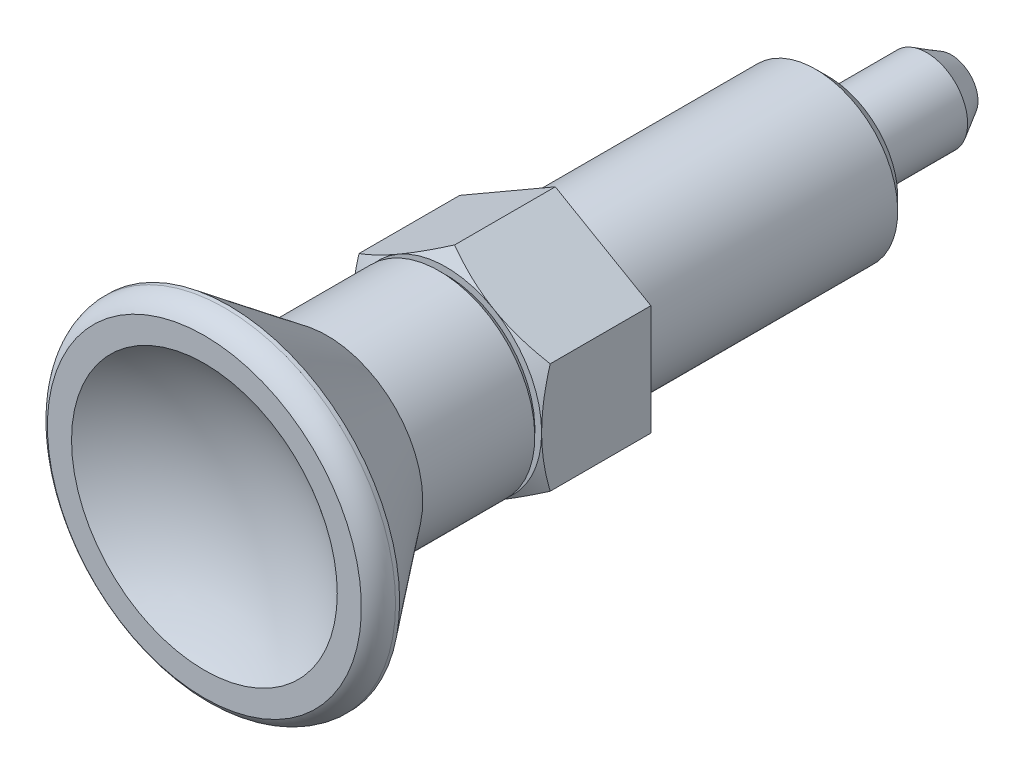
ISO-10303-21;
HEADER;
FILE_DESCRIPTION(('STEP AP214'),'2;1');
FILE_NAME('part.step','',(''),(''),'','','');
FILE_SCHEMA(('AUTOMOTIVE_DESIGN { 1 0 10303 214 1 1 1 1 }'));
ENDSEC;
DATA;
#1=APPLICATION_CONTEXT('core data for automotive mechanical design processes');
#2=APPLICATION_PROTOCOL_DEFINITION('international standard','automotive_design',2000,#1);
#3=PRODUCT_CONTEXT('',#1,'mechanical');
#4=PRODUCT('Part','Part','',(#3));
#5=PRODUCT_RELATED_PRODUCT_CATEGORY('part','',(#4));
#6=PRODUCT_DEFINITION_FORMATION('','',#4);
#7=PRODUCT_DEFINITION_CONTEXT('part definition',#1,'design');
#8=PRODUCT_DEFINITION('design','',#6,#7);
#9=PRODUCT_DEFINITION_SHAPE('','',#8);
#10=(LENGTH_UNIT() NAMED_UNIT(*) SI_UNIT(.MILLI.,.METRE.));
#11=(NAMED_UNIT(*) PLANE_ANGLE_UNIT() SI_UNIT($,.RADIAN.));
#12=(NAMED_UNIT(*) SI_UNIT($,.STERADIAN.) SOLID_ANGLE_UNIT());
#13=UNCERTAINTY_MEASURE_WITH_UNIT(LENGTH_MEASURE(1.E-05),#10,'distance_accuracy_value','');
#14=(GEOMETRIC_REPRESENTATION_CONTEXT(3) GLOBAL_UNCERTAINTY_ASSIGNED_CONTEXT((#13)) GLOBAL_UNIT_ASSIGNED_CONTEXT((#10,
#11,#12)) REPRESENTATION_CONTEXT('',''));
#15=CARTESIAN_POINT('',(0.,0.,0.));
#16=DIRECTION('',(0.,0.,1.));
#17=DIRECTION('',(1.,0.,0.));
#18=AXIS2_PLACEMENT_3D('',#15,#16,#17);
#19=CARTESIAN_POINT('',(0.,0.,6.2679491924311));
#20=DIRECTION('',(0.,0.,-1.));
#21=DIRECTION('',(0.,1.,0.));
#22=AXIS2_PLACEMENT_3D('',#19,#20,#21);
#23=CONICAL_SURFACE('',#22,10.,1.0471975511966);
#24=CARTESIAN_POINT('',(-7.,10.8728092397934,4.57557437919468));
#25=CARTESIAN_POINT('',(-7.,10.566937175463,4.72401792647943));
#26=CARTESIAN_POINT('',(-7.,10.260364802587,4.87104307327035));
#27=CARTESIAN_POINT('',(-7.,9.64544708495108,5.16145919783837));
#28=CARTESIAN_POINT('',(-7.,9.33710147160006,5.30484960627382));
#29=CARTESIAN_POINT('',(-7.,8.71668430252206,5.58791667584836));
#30=CARTESIAN_POINT('',(-7.,8.404601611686,5.72756901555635));
#31=CARTESIAN_POINT('',(-7.,7.77796010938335,6.00118155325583));
#32=CARTESIAN_POINT('',(-7.,7.46340141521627,6.13514201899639));
#33=CARTESIAN_POINT('',(-7.,6.82107443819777,6.40008958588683));
#34=CARTESIAN_POINT('',(-7.,6.49320807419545,6.53084021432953));
#35=CARTESIAN_POINT('',(-7.,5.83364655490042,6.78248688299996));
#36=CARTESIAN_POINT('',(-7.,5.50195097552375,6.90338181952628));
#37=CARTESIAN_POINT('',(-7.,4.83481472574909,7.13215538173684));
#38=CARTESIAN_POINT('',(-7.,4.49938313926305,7.24006021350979));
#39=CARTESIAN_POINT('',(-7.,3.82372022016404,7.43940359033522));
#40=CARTESIAN_POINT('',(-7.,3.48349043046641,7.53084730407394));
#41=CARTESIAN_POINT('',(-7.,2.79988120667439,7.6923959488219));
#42=CARTESIAN_POINT('',(-7.,2.45653013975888,7.76261768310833));
#43=CARTESIAN_POINT('',(-7.,1.93836281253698,7.8490042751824));
#44=CARTESIAN_POINT('',(-7.,1.76510408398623,7.8746433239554));
#45=CARTESIAN_POINT('',(-7.,1.41772046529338,7.91910342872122));
#46=CARTESIAN_POINT('',(-7.,1.2435956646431,7.93792517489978));
#47=CARTESIAN_POINT('',(-7.,0.896993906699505,7.96813897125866));
#48=CARTESIAN_POINT('',(-7.,0.72452516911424,7.97962494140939));
#49=CARTESIAN_POINT('',(-7.,0.379256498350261,7.99529235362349));
#50=CARTESIAN_POINT('',(-7.,0.20645657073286,7.99947391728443));
#51=CARTESIAN_POINT('',(-7.,-0.139165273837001,8.00043271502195));
#52=CARTESIAN_POINT('',(-7.,-0.31198719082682,7.99720993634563));
#53=CARTESIAN_POINT('',(-7.,-0.65734110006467,7.9834390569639));
#54=CARTESIAN_POINT('',(-7.,-0.829873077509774,7.97289059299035));
#55=CARTESIAN_POINT('',(-7.,-1.24401482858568,7.93900155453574));
#56=CARTESIAN_POINT('',(-7.,-1.4853484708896,7.9122132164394));
#57=CARTESIAN_POINT('',(-7.,-1.96622430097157,7.84576103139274));
#58=CARTESIAN_POINT('',(-7.,-2.20576624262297,7.80609544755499));
#59=CARTESIAN_POINT('',(-7.,-2.9214316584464,7.66988610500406));
#60=CARTESIAN_POINT('',(-7.,-3.39432712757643,7.55615455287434));
#61=CARTESIAN_POINT('',(-7.,-4.10143138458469,7.35893674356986));
#62=CARTESIAN_POINT('',(-7.,-4.33930824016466,7.28784545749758));
#63=CARTESIAN_POINT('',(-7.,-4.81275170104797,7.13827828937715));
#64=CARTESIAN_POINT('',(-7.,-5.04831829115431,7.0598023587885));
#65=CARTESIAN_POINT('',(-7.,-5.51721503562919,6.89672505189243));
#66=CARTESIAN_POINT('',(-7.,-5.75054589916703,6.81212569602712));
#67=CARTESIAN_POINT('',(-7.,-6.21527462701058,6.63779697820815));
#68=CARTESIAN_POINT('',(-7.,-6.44667251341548,6.54806767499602));
#69=CARTESIAN_POINT('',(-7.,-6.9904007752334,6.33139429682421));
#70=CARTESIAN_POINT('',(-7.,-7.30200844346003,6.20264005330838));
#71=CARTESIAN_POINT('',(-7.,-7.92258489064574,5.93890362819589));
#72=CARTESIAN_POINT('',(-7.,-8.23155350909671,5.80392107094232));
#73=CARTESIAN_POINT('',(-7.,-8.84733332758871,5.52897125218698));
#74=CARTESIAN_POINT('',(-7.,-9.15414408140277,5.38900299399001));
#75=CARTESIAN_POINT('',(-7.,-9.76591583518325,5.10507365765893));
#76=CARTESIAN_POINT('',(-7.,-10.0708767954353,4.96111249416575));
#77=CARTESIAN_POINT('',(-7.,-10.6795676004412,4.66979092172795));
#78=CARTESIAN_POINT('',(-7.,-10.983295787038,4.52242705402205));
#79=CARTESIAN_POINT('',(-7.,-11.589440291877,4.22502308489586));
#80=CARTESIAN_POINT('',(-7.,-11.8918565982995,4.07498295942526));
#81=CARTESIAN_POINT('',(-7.,-12.7973693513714,3.62159659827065));
#82=CARTESIAN_POINT('',(-7.,-13.3988107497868,3.31494523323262));
#83=CARTESIAN_POINT('',(-7.,-14.5484593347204,2.7212659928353));
#84=CARTESIAN_POINT('',(-7.,-15.0969237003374,2.43473390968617));
#85=CARTESIAN_POINT('',(-7.,-16.1918004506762,1.85773227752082));
#86=CARTESIAN_POINT('',(-7.,-16.7382127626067,1.56726259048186));
#87=CARTESIAN_POINT('',(-7.,-17.8280753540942,0.984049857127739));
#88=CARTESIAN_POINT('',(-7.,-18.3715296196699,0.691314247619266));
#89=CARTESIAN_POINT('',(-7.,-19.4571245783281,0.103487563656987));
#90=CARTESIAN_POINT('',(-7.,-19.9992653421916,-0.191603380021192));
#91=CARTESIAN_POINT('',(-7.,-20.5409220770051,-0.48757414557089));
#92=B_SPLINE_CURVE_WITH_KNOTS('',3,(#24,#25,#26,#27,#28,#29,#30,#31,#32,#33,#34,#35,#36,#37,#38,
#39,#40,#41,#42,#43,#44,#45,#46,#47,#48,#49,#50,#51,#52,#53,#54,#55,#56,#57,#58,#59,#60,#61,#62,
#63,#64,#65,#66,#67,#68,#69,#70,#71,#72,#73,#74,#75,#76,#77,#78,#79,#80,#81,#82,#83,#84,#85,#86,
#87,#88,#89,#90,#91),.UNSPECIFIED.,.F.,.F.,(4,2,2,2,2,2,2,2,2,2,2,2,2,2,2,2,2,2,2,2,2,2,2,2,2,2,
2,2,2,2,2,2,2,4),(0.,1.01998239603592,2.0401235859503,3.06579018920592,4.0914084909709,
5.15021362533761,6.20913716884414,7.26588732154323,8.32230508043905,9.37279786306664,
9.89812137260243,10.4233916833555,10.9417945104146,11.4601887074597,11.9785837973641,
12.4970045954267,13.2250410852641,13.953175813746,15.4102478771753,16.1550039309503,
16.8997648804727,17.6442812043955,18.3887890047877,19.4001785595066,20.4116291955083,
21.4232831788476,22.434958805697,23.4477124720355,24.4604752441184,26.485730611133,
28.3421144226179,30.1985634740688,32.0504023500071,33.9021391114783),.UNSPECIFIED.);
#93=CARTESIAN_POINT('',(-7.,-4.0414518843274,7.3747852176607));
#94=VERTEX_POINT('',#93);
#95=CARTESIAN_POINT('',(-7.,0.,8.));
#96=VERTEX_POINT('',#95);
#97=EDGE_CURVE('E9',#94,#96,#92,.F.);
#98=ORIENTED_EDGE('',*,*,#97,.F.);
#99=CARTESIAN_POINT('',(0.00020000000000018,-8.08301923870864,7.37471854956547));
#100=CARTESIAN_POINT('',(-0.153667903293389,-7.99418356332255,7.42600015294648));
#101=CARTESIAN_POINT('',(-0.308109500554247,-7.90501666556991,7.47495440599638));
#102=CARTESIAN_POINT('',(-0.618246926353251,-7.72595873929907,7.56756721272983));
#103=CARTESIAN_POINT('',(-0.773943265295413,-7.63606741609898,7.6112234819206));
#104=CARTESIAN_POINT('',(-1.24352516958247,-7.36495417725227,7.73338840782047));
#105=CARTESIAN_POINT('',(-1.55926433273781,-7.18266208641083,7.80287444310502));
#106=CARTESIAN_POINT('',(-2.03176224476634,-6.90986528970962,7.88435504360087));
#107=CARTESIAN_POINT('',(-2.1871092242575,-6.8201756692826,7.9075665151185));
#108=CARTESIAN_POINT('',(-2.49850511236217,-6.64039116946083,7.94648878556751));
#109=CARTESIAN_POINT('',(-2.65455395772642,-6.55029632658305,7.96220024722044));
#110=CARTESIAN_POINT('',(-2.96692267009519,-6.36995016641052,7.98572208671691));
#111=CARTESIAN_POINT('',(-3.12324202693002,-6.27969914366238,7.9935414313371));
#112=CARTESIAN_POINT('',(-3.43601650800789,-6.09911871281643,8.00111975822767));
#113=CARTESIAN_POINT('',(-3.59247162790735,-6.00878930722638,8.000878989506));
#114=CARTESIAN_POINT('',(-4.02110687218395,-5.76131663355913,7.9891402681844));
#115=CARTESIAN_POINT('',(-4.29314668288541,-5.60425437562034,7.96943425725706));
#116=CARTESIAN_POINT('',(-4.8354194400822,-5.29117305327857,7.90694653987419));
#117=CARTESIAN_POINT('',(-5.10565047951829,-5.13515508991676,7.86414347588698));
#118=CARTESIAN_POINT('',(-5.64901454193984,-4.8214437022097,7.75714832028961));
#119=CARTESIAN_POINT('',(-5.92207900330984,-4.66378986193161,7.6925029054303));
#120=CARTESIAN_POINT('',(-6.46413578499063,-4.35083323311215,7.54578392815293));
#121=CARTESIAN_POINT('',(-6.73313504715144,-4.19552643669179,7.46374482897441));
#122=CARTESIAN_POINT('',(-7.0002,-4.04133641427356,7.37471854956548));
#123=B_SPLINE_CURVE_WITH_KNOTS('',3,(#99,#100,#101,#102,#103,#104,#105,#106,#107,#108,#109,#110,
#111,#112,#113,#114,#115,#116,#117,#118,#119,#120,#121,#122),.UNSPECIFIED.,.F.,.F.,(4,2,2,2,2,2,
2,2,2,2,2,4),(0.,0.554727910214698,1.1096941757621,2.22193274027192,2.76443041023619,
3.3068801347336,3.84871284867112,4.39052882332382,5.33376515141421,6.27787517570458,
7.24292418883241,8.20607866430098),.UNSPECIFIED.);
#124=CARTESIAN_POINT('',(-3.5,-6.06217782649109,8.));
#125=VERTEX_POINT('',#124);
#126=EDGE_CURVE('E201',#125,#94,#123,.T.);
#127=ORIENTED_EDGE('',*,*,#126,.F.);
#128=CARTESIAN_POINT('',(0.,0.,8.));
#129=DIRECTION('',(0.,0.,1.));
#130=DIRECTION('',(0.,-1.,0.));
#131=AXIS2_PLACEMENT_3D('',#128,#129,#130);
#132=CIRCLE('',#131,7.);
#133=EDGE_CURVE('E260',#96,#125,#132,.T.);
#134=ORIENTED_EDGE('',*,*,#133,.F.);
#135=EDGE_LOOP('',(#98,#127,#134));
#136=FACE_BOUND('',#135,.T.);
#137=ADVANCED_FACE('F14',(#136),#23,.T.);
#138=CARTESIAN_POINT('',(-7.,4.0414518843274,7.3747852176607));
#139=VERTEX_POINT('',#138);
#140=EDGE_CURVE('E18',#96,#139,#92,.F.);
#141=ORIENTED_EDGE('',*,*,#140,.F.);
#142=CARTESIAN_POINT('',(-3.5,6.06217782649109,8.));
#143=VERTEX_POINT('',#142);
#144=EDGE_CURVE('E116',#143,#96,#132,.T.);
#145=ORIENTED_EDGE('',*,*,#144,.F.);
#146=CARTESIAN_POINT('',(-7.0002,4.04133641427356,7.37471854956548));
#147=CARTESIAN_POINT('',(-6.84633209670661,4.13017208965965,7.42600015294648));
#148=CARTESIAN_POINT('',(-6.69189049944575,4.21933898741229,7.47495440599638));
#149=CARTESIAN_POINT('',(-6.38175307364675,4.39839691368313,7.56756721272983));
#150=CARTESIAN_POINT('',(-6.22605673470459,4.48828823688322,7.6112234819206));
#151=CARTESIAN_POINT('',(-5.75647483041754,4.75940147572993,7.73338840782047));
#152=CARTESIAN_POINT('',(-5.4407356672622,4.94169356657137,7.80287444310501));
#153=CARTESIAN_POINT('',(-4.96823775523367,5.21449036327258,7.88435504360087));
#154=CARTESIAN_POINT('',(-4.81289077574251,5.30417998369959,7.90756651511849));
#155=CARTESIAN_POINT('',(-4.50149488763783,5.48396448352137,7.9464887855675));
#156=CARTESIAN_POINT('',(-4.34544604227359,5.57405932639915,7.96220024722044));
#157=CARTESIAN_POINT('',(-4.03307732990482,5.75440548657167,7.9857220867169));
#158=CARTESIAN_POINT('',(-3.87675797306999,5.84465650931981,7.9935414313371));
#159=CARTESIAN_POINT('',(-3.56398349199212,6.02523694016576,8.00111975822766));
#160=CARTESIAN_POINT('',(-3.40752837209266,6.11556634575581,8.00087898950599));
#161=CARTESIAN_POINT('',(-2.97889312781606,6.36303901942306,7.98914026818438));
#162=CARTESIAN_POINT('',(-2.7068533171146,6.52010127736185,7.96943425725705));
#163=CARTESIAN_POINT('',(-2.1645805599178,6.83318259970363,7.90694653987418));
#164=CARTESIAN_POINT('',(-1.89434952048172,6.98920056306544,7.86414347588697));
#165=CARTESIAN_POINT('',(-1.35098545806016,7.30291195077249,7.7571483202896));
#166=CARTESIAN_POINT('',(-1.07792099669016,7.46056579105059,7.69250290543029));
#167=CARTESIAN_POINT('',(-0.535864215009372,7.77352241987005,7.54578392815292));
#168=CARTESIAN_POINT('',(-0.266864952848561,7.92882921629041,7.4637448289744));
#169=CARTESIAN_POINT('',(0.000200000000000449,8.08301923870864,7.37471854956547));
#170=B_SPLINE_CURVE_WITH_KNOTS('',3,(#146,#147,#148,#149,#150,#151,#152,#153,#154,#155,#156,
#157,#158,#159,#160,#161,#162,#163,#164,#165,#166,#167,#168,#169),.UNSPECIFIED.,.F.,.F.,(4,2,2,
2,2,2,2,2,2,2,2,4),(0.,0.554727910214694,1.10969417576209,2.22193274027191,2.76443041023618,
3.30688013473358,3.84871284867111,4.3905288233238,5.33376515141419,6.27787517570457,
7.24292418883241,8.20607866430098),.UNSPECIFIED.);
#171=EDGE_CURVE('E263',#139,#143,#170,.T.);
#172=ORIENTED_EDGE('',*,*,#171,.F.);
#173=EDGE_LOOP('',(#141,#145,#172));
#174=FACE_BOUND('',#173,.T.);
#175=ADVANCED_FACE('F222',(#174),#23,.T.);
#176=CARTESIAN_POINT('',(0.,8.0829037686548,7.37478521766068));
#177=VERTEX_POINT('',#176);
#178=EDGE_CURVE('E112',#143,#177,#170,.T.);
#179=ORIENTED_EDGE('',*,*,#178,.F.);
#180=CARTESIAN_POINT('',(3.5,6.06217782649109,8.));
#181=VERTEX_POINT('',#180);
#182=EDGE_CURVE('E110',#181,#143,#132,.T.);
#183=ORIENTED_EDGE('',*,*,#182,.F.);
#184=CARTESIAN_POINT('',(-0.00020000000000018,8.08301923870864,7.37471854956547));
#185=CARTESIAN_POINT('',(0.153667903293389,7.99418356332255,7.42600015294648));
#186=CARTESIAN_POINT('',(0.308109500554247,7.90501666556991,7.47495440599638));
#187=CARTESIAN_POINT('',(0.618246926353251,7.72595873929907,7.56756721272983));
#188=CARTESIAN_POINT('',(0.773943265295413,7.63606741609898,7.6112234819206));
#189=CARTESIAN_POINT('',(1.24352516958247,7.36495417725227,7.73338840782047));
#190=CARTESIAN_POINT('',(1.55926433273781,7.18266208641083,7.80287444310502));
#191=CARTESIAN_POINT('',(2.03176224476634,6.90986528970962,7.88435504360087));
#192=CARTESIAN_POINT('',(2.1871092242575,6.8201756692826,7.9075665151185));
#193=CARTESIAN_POINT('',(2.49850511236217,6.64039116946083,7.94648878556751));
#194=CARTESIAN_POINT('',(2.65455395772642,6.55029632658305,7.96220024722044));
#195=CARTESIAN_POINT('',(2.96692267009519,6.36995016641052,7.98572208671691));
#196=CARTESIAN_POINT('',(3.12324202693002,6.27969914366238,7.9935414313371));
#197=CARTESIAN_POINT('',(3.43601650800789,6.09911871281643,8.00111975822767));
#198=CARTESIAN_POINT('',(3.59247162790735,6.00878930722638,8.000878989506));
#199=CARTESIAN_POINT('',(4.02110687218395,5.76131663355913,7.9891402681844));
#200=CARTESIAN_POINT('',(4.29314668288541,5.60425437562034,7.96943425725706));
#201=CARTESIAN_POINT('',(4.8354194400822,5.29117305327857,7.90694653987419));
#202=CARTESIAN_POINT('',(5.10565047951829,5.13515508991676,7.86414347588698));
#203=CARTESIAN_POINT('',(5.64901454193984,4.8214437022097,7.75714832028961));
#204=CARTESIAN_POINT('',(5.92207900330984,4.66378986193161,7.6925029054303));
#205=CARTESIAN_POINT('',(6.46413578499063,4.35083323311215,7.54578392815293));
#206=CARTESIAN_POINT('',(6.73313504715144,4.19552643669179,7.46374482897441));
#207=CARTESIAN_POINT('',(7.0002,4.04133641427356,7.37471854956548));
#208=B_SPLINE_CURVE_WITH_KNOTS('',3,(#184,#185,#186,#187,#188,#189,#190,#191,#192,#193,#194,
#195,#196,#197,#198,#199,#200,#201,#202,#203,#204,#205,#206,#207),.UNSPECIFIED.,.F.,.F.,(4,2,2,
2,2,2,2,2,2,2,2,4),(0.,0.554727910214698,1.1096941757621,2.22193274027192,2.76443041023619,
3.3068801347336,3.84871284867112,4.39052882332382,5.33376515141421,6.27787517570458,
7.24292418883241,8.20607866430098),.UNSPECIFIED.);
#209=EDGE_CURVE('E90',#177,#181,#208,.T.);
#210=ORIENTED_EDGE('',*,*,#209,.F.);
#211=EDGE_LOOP('',(#179,#183,#210));
#212=FACE_BOUND('',#211,.T.);
#213=ADVANCED_FACE('F111',(#212),#23,.T.);
#214=CARTESIAN_POINT('',(0.,-8.0829037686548,7.37478521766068));
#215=VERTEX_POINT('',#214);
#216=EDGE_CURVE('E196',#215,#125,#123,.T.);
#217=ORIENTED_EDGE('',*,*,#216,.F.);
#218=CARTESIAN_POINT('',(7.0002,-4.04133641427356,7.37471854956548));
#219=CARTESIAN_POINT('',(6.84633209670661,-4.13017208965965,7.42600015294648));
#220=CARTESIAN_POINT('',(6.69189049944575,-4.21933898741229,7.47495440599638));
#221=CARTESIAN_POINT('',(6.38175307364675,-4.39839691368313,7.56756721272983));
#222=CARTESIAN_POINT('',(6.22605673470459,-4.48828823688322,7.6112234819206));
#223=CARTESIAN_POINT('',(5.75647483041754,-4.75940147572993,7.73338840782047));
#224=CARTESIAN_POINT('',(5.4407356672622,-4.94169356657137,7.80287444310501));
#225=CARTESIAN_POINT('',(4.96823775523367,-5.21449036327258,7.88435504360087));
#226=CARTESIAN_POINT('',(4.81289077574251,-5.30417998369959,7.90756651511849));
#227=CARTESIAN_POINT('',(4.50149488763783,-5.48396448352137,7.9464887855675));
#228=CARTESIAN_POINT('',(4.34544604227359,-5.57405932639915,7.96220024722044));
#229=CARTESIAN_POINT('',(4.03307732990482,-5.75440548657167,7.9857220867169));
#230=CARTESIAN_POINT('',(3.87675797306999,-5.84465650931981,7.9935414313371));
#231=CARTESIAN_POINT('',(3.56398349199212,-6.02523694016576,8.00111975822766));
#232=CARTESIAN_POINT('',(3.40752837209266,-6.11556634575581,8.00087898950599));
#233=CARTESIAN_POINT('',(2.97889312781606,-6.36303901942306,7.98914026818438));
#234=CARTESIAN_POINT('',(2.7068533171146,-6.52010127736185,7.96943425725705));
#235=CARTESIAN_POINT('',(2.1645805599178,-6.83318259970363,7.90694653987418));
#236=CARTESIAN_POINT('',(1.89434952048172,-6.98920056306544,7.86414347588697));
#237=CARTESIAN_POINT('',(1.35098545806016,-7.30291195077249,7.7571483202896));
#238=CARTESIAN_POINT('',(1.07792099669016,-7.46056579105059,7.69250290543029));
#239=CARTESIAN_POINT('',(0.535864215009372,-7.77352241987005,7.54578392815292));
#240=CARTESIAN_POINT('',(0.266864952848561,-7.92882921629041,7.4637448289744));
#241=CARTESIAN_POINT('',(-0.000200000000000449,-8.08301923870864,7.37471854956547));
#242=B_SPLINE_CURVE_WITH_KNOTS('',3,(#218,#219,#220,#221,#222,#223,#224,#225,#226,#227,#228,
#229,#230,#231,#232,#233,#234,#235,#236,#237,#238,#239,#240,#241),.UNSPECIFIED.,.F.,.F.,(4,2,2,
2,2,2,2,2,2,2,2,4),(0.,0.554727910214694,1.10969417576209,2.22193274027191,2.76443041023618,
3.30688013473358,3.84871284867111,4.3905288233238,5.33376515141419,6.27787517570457,
7.24292418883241,8.20607866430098),.UNSPECIFIED.);
#243=CARTESIAN_POINT('',(3.5,-6.06217782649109,8.));
#244=VERTEX_POINT('',#243);
#245=EDGE_CURVE('E100',#244,#215,#242,.T.);
#246=ORIENTED_EDGE('',*,*,#245,.F.);
#247=EDGE_CURVE('E123',#125,#244,#132,.T.);
#248=ORIENTED_EDGE('',*,*,#247,.F.);
#249=EDGE_LOOP('',(#217,#246,#248));
#250=FACE_BOUND('',#249,.T.);
#251=ADVANCED_FACE('F242',(#250),#23,.T.);
#252=CARTESIAN_POINT('',(7.,4.0414518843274,7.3747852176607));
#253=VERTEX_POINT('',#252);
#254=EDGE_CURVE('E94',#181,#253,#208,.T.);
#255=ORIENTED_EDGE('',*,*,#254,.F.);
#256=CARTESIAN_POINT('',(7.,0.,8.));
#257=VERTEX_POINT('',#256);
#258=EDGE_CURVE('E106',#257,#181,#132,.T.);
#259=ORIENTED_EDGE('',*,*,#258,.F.);
#260=CARTESIAN_POINT('',(7.,10.8728092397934,4.57557437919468));
#261=CARTESIAN_POINT('',(7.,10.566937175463,4.72401792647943));
#262=CARTESIAN_POINT('',(7.,10.260364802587,4.87104307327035));
#263=CARTESIAN_POINT('',(7.,9.64544708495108,5.16145919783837));
#264=CARTESIAN_POINT('',(7.,9.33710147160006,5.30484960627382));
#265=CARTESIAN_POINT('',(7.,8.71668430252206,5.58791667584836));
#266=CARTESIAN_POINT('',(7.,8.404601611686,5.72756901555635));
#267=CARTESIAN_POINT('',(7.,7.77796010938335,6.00118155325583));
#268=CARTESIAN_POINT('',(7.,7.46340141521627,6.13514201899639));
#269=CARTESIAN_POINT('',(7.,6.82107443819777,6.40008958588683));
#270=CARTESIAN_POINT('',(7.,6.49320807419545,6.53084021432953));
#271=CARTESIAN_POINT('',(7.,5.83364655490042,6.78248688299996));
#272=CARTESIAN_POINT('',(7.,5.50195097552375,6.90338181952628));
#273=CARTESIAN_POINT('',(7.,4.83481472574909,7.13215538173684));
#274=CARTESIAN_POINT('',(7.,4.49938313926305,7.24006021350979));
#275=CARTESIAN_POINT('',(7.,3.82372022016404,7.43940359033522));
#276=CARTESIAN_POINT('',(7.,3.48349043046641,7.53084730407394));
#277=CARTESIAN_POINT('',(7.,2.79988120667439,7.6923959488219));
#278=CARTESIAN_POINT('',(7.,2.45653013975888,7.76261768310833));
#279=CARTESIAN_POINT('',(7.,1.93836281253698,7.8490042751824));
#280=CARTESIAN_POINT('',(7.,1.76510408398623,7.8746433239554));
#281=CARTESIAN_POINT('',(7.,1.41772046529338,7.91910342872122));
#282=CARTESIAN_POINT('',(7.,1.2435956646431,7.93792517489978));
#283=CARTESIAN_POINT('',(7.,0.896993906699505,7.96813897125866));
#284=CARTESIAN_POINT('',(7.,0.72452516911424,7.97962494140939));
#285=CARTESIAN_POINT('',(7.,0.379256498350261,7.99529235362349));
#286=CARTESIAN_POINT('',(7.,0.20645657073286,7.99947391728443));
#287=CARTESIAN_POINT('',(7.,-0.139165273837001,8.00043271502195));
#288=CARTESIAN_POINT('',(7.,-0.31198719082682,7.99720993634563));
#289=CARTESIAN_POINT('',(7.,-0.65734110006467,7.9834390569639));
#290=CARTESIAN_POINT('',(7.,-0.829873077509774,7.97289059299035));
#291=CARTESIAN_POINT('',(7.,-1.24401482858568,7.93900155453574));
#292=CARTESIAN_POINT('',(7.,-1.4853484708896,7.9122132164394));
#293=CARTESIAN_POINT('',(7.,-1.96622430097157,7.84576103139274));
#294=CARTESIAN_POINT('',(7.,-2.20576624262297,7.80609544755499));
#295=CARTESIAN_POINT('',(7.,-2.9214316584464,7.66988610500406));
#296=CARTESIAN_POINT('',(7.,-3.39432712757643,7.55615455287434));
#297=CARTESIAN_POINT('',(7.,-4.10143138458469,7.35893674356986));
#298=CARTESIAN_POINT('',(7.,-4.33930824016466,7.28784545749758));
#299=CARTESIAN_POINT('',(7.,-4.81275170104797,7.13827828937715));
#300=CARTESIAN_POINT('',(7.,-5.04831829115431,7.0598023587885));
#301=CARTESIAN_POINT('',(7.,-5.51721503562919,6.89672505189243));
#302=CARTESIAN_POINT('',(7.,-5.75054589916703,6.81212569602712));
#303=CARTESIAN_POINT('',(7.,-6.21527462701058,6.63779697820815));
#304=CARTESIAN_POINT('',(7.,-6.44667251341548,6.54806767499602));
#305=CARTESIAN_POINT('',(7.,-6.9904007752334,6.33139429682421));
#306=CARTESIAN_POINT('',(7.,-7.30200844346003,6.20264005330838));
#307=CARTESIAN_POINT('',(7.,-7.92258489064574,5.93890362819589));
#308=CARTESIAN_POINT('',(7.,-8.23155350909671,5.80392107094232));
#309=CARTESIAN_POINT('',(7.,-8.84733332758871,5.52897125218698));
#310=CARTESIAN_POINT('',(7.,-9.15414408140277,5.38900299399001));
#311=CARTESIAN_POINT('',(7.,-9.76591583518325,5.10507365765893));
#312=CARTESIAN_POINT('',(7.,-10.0708767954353,4.96111249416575));
#313=CARTESIAN_POINT('',(7.,-10.6795676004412,4.66979092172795));
#314=CARTESIAN_POINT('',(7.,-10.983295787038,4.52242705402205));
#315=CARTESIAN_POINT('',(7.,-11.589440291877,4.22502308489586));
#316=CARTESIAN_POINT('',(7.,-11.8918565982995,4.07498295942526));
#317=CARTESIAN_POINT('',(7.,-12.7973693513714,3.62159659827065));
#318=CARTESIAN_POINT('',(7.,-13.3988107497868,3.31494523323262));
#319=CARTESIAN_POINT('',(7.,-14.5484593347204,2.7212659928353));
#320=CARTESIAN_POINT('',(7.,-15.0969237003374,2.43473390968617));
#321=CARTESIAN_POINT('',(7.,-16.1918004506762,1.85773227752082));
#322=CARTESIAN_POINT('',(7.,-16.7382127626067,1.56726259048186));
#323=CARTESIAN_POINT('',(7.,-17.8280753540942,0.984049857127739));
#324=CARTESIAN_POINT('',(7.,-18.3715296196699,0.691314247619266));
#325=CARTESIAN_POINT('',(7.,-19.4571245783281,0.103487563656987));
#326=CARTESIAN_POINT('',(7.,-19.9992653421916,-0.191603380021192));
#327=CARTESIAN_POINT('',(7.,-20.5409220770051,-0.48757414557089));
#328=B_SPLINE_CURVE_WITH_KNOTS('',3,(#260,#261,#262,#263,#264,#265,#266,#267,#268,#269,#270,
#271,#272,#273,#274,#275,#276,#277,#278,#279,#280,#281,#282,#283,#284,#285,#286,#287,#288,#289,
#290,#291,#292,#293,#294,#295,#296,#297,#298,#299,#300,#301,#302,#303,#304,#305,#306,#307,#308,
#309,#310,#311,#312,#313,#314,#315,#316,#317,#318,#319,#320,#321,#322,#323,#324,#325,#326,#327),
.UNSPECIFIED.,.F.,.F.,(4,2,2,2,2,2,2,2,2,2,2,2,2,2,2,2,2,2,2,2,2,2,2,2,2,2,2,2,2,2,2,2,2,4),(0.,
1.01998239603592,2.0401235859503,3.06579018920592,4.0914084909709,5.15021362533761,
6.20913716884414,7.26588732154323,8.32230508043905,9.37279786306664,9.89812137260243,
10.4233916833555,10.9417945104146,11.4601887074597,11.9785837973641,12.4970045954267,
13.2250410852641,13.953175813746,15.4102478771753,16.1550039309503,16.8997648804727,
17.6442812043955,18.3887890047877,19.4001785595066,20.4116291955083,21.4232831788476,
22.434958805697,23.4477124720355,24.4604752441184,26.485730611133,28.3421144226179,
30.1985634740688,32.0504023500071,33.9021391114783),.UNSPECIFIED.);
#329=EDGE_CURVE('E41',#253,#257,#328,.T.);
#330=ORIENTED_EDGE('',*,*,#329,.F.);
#331=EDGE_LOOP('',(#255,#259,#330));
#332=FACE_BOUND('',#331,.T.);
#333=ADVANCED_FACE('F104',(#332),#23,.T.);
#334=CARTESIAN_POINT('',(7.,-4.0414518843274,7.3747852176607));
#335=VERTEX_POINT('',#334);
#336=EDGE_CURVE('E108',#335,#244,#242,.T.);
#337=ORIENTED_EDGE('',*,*,#336,.F.);
#338=EDGE_CURVE('E166',#257,#335,#328,.T.);
#339=ORIENTED_EDGE('',*,*,#338,.F.);
#340=EDGE_CURVE('E121',#244,#257,#132,.T.);
#341=ORIENTED_EDGE('',*,*,#340,.F.);
#342=EDGE_LOOP('',(#337,#339,#341));
#343=FACE_BOUND('',#342,.T.);
#344=ADVANCED_FACE('F224',(#343),#23,.T.);
#345=CARTESIAN_POINT('',(2.10421957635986E-12,0.,38.3999999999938));
#346=DIRECTION('',(0.,0.,1.));
#347=DIRECTION('',(-1.,0.,0.));
#348=AXIS2_PLACEMENT_3D('',#345,#346,#347);
#349=SPHERICAL_SURFACE('',#348,15.9999999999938);
#350=CARTESIAN_POINT('',(0.,0.,25.7));
#351=DIRECTION('',(0.,0.,1.));
#352=DIRECTION('',(0.,-1.,0.));
#353=AXIS2_PLACEMENT_3D('',#350,#351,#352);
#354=CIRCLE('',#353,9.73190628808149);
#355=CARTESIAN_POINT('',(0.,-9.73190628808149,25.7));
#356=VERTEX_POINT('',#355);
#357=EDGE_CURVE('E163',#356,#356,#354,.T.);
#358=ORIENTED_EDGE('',*,*,#357,.T.);
#359=EDGE_LOOP('',(#358));
#360=FACE_BOUND('',#359,.T.);
#361=ADVANCED_FACE('F16',(#360),#349,.F.);
#362=CARTESIAN_POINT('',(9.7319062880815,0.,25.7));
#363=DIRECTION('',(0.,0.,1.));
#364=DIRECTION('',(0.,-1.,0.));
#365=AXIS2_PLACEMENT_3D('',#362,#363,#364);
#366=PLANE('',#365);
#367=CARTESIAN_POINT('',(0.,0.,25.7));
#368=DIRECTION('',(0.,0.,1.));
#369=DIRECTION('',(0.,-1.,0.));
#370=AXIS2_PLACEMENT_3D('',#367,#368,#369);
#371=CIRCLE('',#370,11.5);
#372=CARTESIAN_POINT('',(0.,-11.5,25.7));
#373=VERTEX_POINT('',#372);
#374=EDGE_CURVE('E160',#373,#373,#371,.T.);
#375=ORIENTED_EDGE('',*,*,#374,.T.);
#376=EDGE_LOOP('',(#375));
#377=FACE_BOUND('',#376,.T.);
#378=ORIENTED_EDGE('',*,*,#357,.F.);
#379=EDGE_LOOP('',(#378));
#380=FACE_BOUND('',#379,.T.);
#381=ADVANCED_FACE('F240',(#377,#380),#366,.T.);
#382=CARTESIAN_POINT('',(0.,0.,23.9596620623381));
#383=DIRECTION('',(0.,0.,1.));
#384=DIRECTION('',(0.,-1.,0.));
#385=AXIS2_PLACEMENT_3D('',#382,#383,#384);
#386=TOROIDAL_SURFACE('',#385,10.5144930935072,2.00000000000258);
#387=CARTESIAN_POINT('',(0.,0.,24.2));
#388=DIRECTION('',(0.,0.,1.));
#389=DIRECTION('',(0.,-1.,0.));
#390=AXIS2_PLACEMENT_3D('',#387,#388,#389);
#391=CIRCLE('',#390,12.5);
#392=CARTESIAN_POINT('',(0.,-12.5,24.2));
#393=VERTEX_POINT('',#392);
#394=EDGE_CURVE('E157',#393,#393,#391,.T.);
#395=ORIENTED_EDGE('',*,*,#394,.T.);
#396=EDGE_LOOP('',(#395));
#397=FACE_BOUND('',#396,.T.);
#398=ORIENTED_EDGE('',*,*,#374,.F.);
#399=EDGE_LOOP('',(#398));
#400=FACE_BOUND('',#399,.T.);
#401=ADVANCED_FACE('F335',(#397,#400),#386,.T.);
#402=CARTESIAN_POINT('',(0.,0.,-29.));
#403=DIRECTION('',(0.,0.,1.));
#404=DIRECTION('',(0.,-1.,0.));
#405=AXIS2_PLACEMENT_3D('',#402,#403,#404);
#406=CYLINDRICAL_SURFACE('',#405,12.5);
#407=CARTESIAN_POINT('',(0.,0.,23.9));
#408=DIRECTION('',(0.,0.,1.));
#409=DIRECTION('',(0.,-1.,0.));
#410=AXIS2_PLACEMENT_3D('',#407,#408,#409);
#411=CIRCLE('',#410,12.5);
#412=CARTESIAN_POINT('',(0.,-12.5,23.9));
#413=VERTEX_POINT('',#412);
#414=EDGE_CURVE('E154',#413,#413,#411,.T.);
#415=ORIENTED_EDGE('',*,*,#414,.T.);
#416=EDGE_LOOP('',(#415));
#417=FACE_BOUND('',#416,.T.);
#418=ORIENTED_EDGE('',*,*,#394,.F.);
#419=EDGE_LOOP('',(#418));
#420=FACE_BOUND('',#419,.T.);
#421=ADVANCED_FACE('F331',(#417,#420),#406,.T.);
#422=CARTESIAN_POINT('',(0.,0.,23.9));
#423=DIRECTION('',(0.,0.,1.));
#424=DIRECTION('',(0.,-1.,0.));
#425=AXIS2_PLACEMENT_3D('',#422,#423,#424);
#426=CONICAL_SURFACE('',#425,12.5,0.652753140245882);
#427=CARTESIAN_POINT('',(0.,0.,16.7062986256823));
#428=DIRECTION('',(0.,0.,1.));
#429=DIRECTION('',(0.,-1.,0.));
#430=AXIS2_PLACEMENT_3D('',#427,#428,#429);
#431=CIRCLE('',#430,7.);
#432=CARTESIAN_POINT('',(0.,-7.,16.7062986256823));
#433=VERTEX_POINT('',#432);
#434=EDGE_CURVE('E151',#433,#433,#431,.T.);
#435=ORIENTED_EDGE('',*,*,#434,.T.);
#436=EDGE_LOOP('',(#435));
#437=FACE_BOUND('',#436,.T.);
#438=ORIENTED_EDGE('',*,*,#414,.F.);
#439=EDGE_LOOP('',(#438));
#440=FACE_BOUND('',#439,.T.);
#441=ADVANCED_FACE('F327',(#437,#440),#426,.T.);
#442=CARTESIAN_POINT('',(0.,0.,-29.));
#443=DIRECTION('',(0.,0.,1.));
#444=DIRECTION('',(0.,-1.,0.));
#445=AXIS2_PLACEMENT_3D('',#442,#443,#444);
#446=CYLINDRICAL_SURFACE('',#445,7.);
#447=CARTESIAN_POINT('',(0.,0.,8.5));
#448=DIRECTION('',(0.,0.,1.));
#449=DIRECTION('',(0.,-1.,0.));
#450=AXIS2_PLACEMENT_3D('',#447,#448,#449);
#451=CIRCLE('',#450,7.);
#452=CARTESIAN_POINT('',(0.,-7.,8.5));
#453=VERTEX_POINT('',#452);
#454=EDGE_CURVE('E148',#453,#453,#451,.T.);
#455=ORIENTED_EDGE('',*,*,#454,.T.);
#456=EDGE_LOOP('',(#455));
#457=FACE_BOUND('',#456,.T.);
#458=ORIENTED_EDGE('',*,*,#434,.F.);
#459=EDGE_LOOP('',(#458));
#460=FACE_BOUND('',#459,.T.);
#461=ADVANCED_FACE('F323',(#457,#460),#446,.T.);
#462=CARTESIAN_POINT('',(0.,0.,8.5));
#463=DIRECTION('',(0.,0.,1.));
#464=DIRECTION('',(0.,-1.,0.));
#465=AXIS2_PLACEMENT_3D('',#462,#463,#464);
#466=CONICAL_SURFACE('',#465,7.,0.785398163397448);
#467=CARTESIAN_POINT('',(0.,0.,8.));
#468=DIRECTION('',(0.,0.,1.));
#469=DIRECTION('',(0.,-1.,0.));
#470=AXIS2_PLACEMENT_3D('',#467,#468,#469);
#471=CIRCLE('',#470,6.5);
#472=CARTESIAN_POINT('',(0.,-6.5,8.));
#473=VERTEX_POINT('',#472);
#474=EDGE_CURVE('E145',#473,#473,#471,.T.);
#475=ORIENTED_EDGE('',*,*,#474,.T.);
#476=EDGE_LOOP('',(#475));
#477=FACE_BOUND('',#476,.T.);
#478=ORIENTED_EDGE('',*,*,#454,.F.);
#479=EDGE_LOOP('',(#478));
#480=FACE_BOUND('',#479,.T.);
#481=ADVANCED_FACE('F309',(#477,#480),#466,.T.);
#482=CARTESIAN_POINT('',(7.,0.,8.));
#483=DIRECTION('',(0.,0.,-1.));
#484=DIRECTION('',(0.,1.,0.));
#485=AXIS2_PLACEMENT_3D('',#482,#483,#484);
#486=PLANE('',#485);
#487=ORIENTED_EDGE('',*,*,#474,.F.);
#488=EDGE_LOOP('',(#487));
#489=FACE_BOUND('',#488,.T.);
#490=ORIENTED_EDGE('',*,*,#340,.T.);
#491=ORIENTED_EDGE('',*,*,#258,.T.);
#492=ORIENTED_EDGE('',*,*,#182,.T.);
#493=ORIENTED_EDGE('',*,*,#144,.T.);
#494=ORIENTED_EDGE('',*,*,#133,.T.);
#495=ORIENTED_EDGE('',*,*,#247,.T.);
#496=EDGE_LOOP('',(#490,#491,#492,#493,#494,#495));
#497=FACE_BOUND('',#496,.T.);
#498=ADVANCED_FACE('F118',(#489,#497),#486,.F.);
#499=CARTESIAN_POINT('',(7.,4.0414518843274,-2.));
#500=DIRECTION('',(0.5,0.866025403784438,0.));
#501=DIRECTION('',(-0.866025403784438,0.5,0.));
#502=AXIS2_PLACEMENT_3D('',#499,#500,#501);
#503=PLANE('',#502);
#504=DIRECTION('',(-0.866025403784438,0.5,0.));
#505=VECTOR('',#504,1.);
#506=CARTESIAN_POINT('',(8.,3.46410161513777,0.));
#507=LINE('',#506,#505);
#508=CARTESIAN_POINT('',(7.,4.0414518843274,0.));
#509=VERTEX_POINT('',#508);
#510=CARTESIAN_POINT('',(0.,8.0829037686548,0.));
#511=VERTEX_POINT('',#510);
#512=EDGE_CURVE('E126',#509,#511,#507,.T.);
#513=ORIENTED_EDGE('',*,*,#512,.T.);
#514=DIRECTION('',(0.,0.,1.));
#515=VECTOR('',#514,1.);
#516=CARTESIAN_POINT('',(0.,8.0829037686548,-2.));
#517=LINE('',#516,#515);
#518=EDGE_CURVE('E96',#511,#177,#517,.T.);
#519=ORIENTED_EDGE('',*,*,#518,.T.);
#520=ORIENTED_EDGE('',*,*,#209,.T.);
#521=ORIENTED_EDGE('',*,*,#254,.T.);
#522=DIRECTION('',(0.,0.,1.));
#523=VECTOR('',#522,1.);
#524=CARTESIAN_POINT('',(7.,4.0414518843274,-2.));
#525=LINE('',#524,#523);
#526=EDGE_CURVE('E284',#509,#253,#525,.T.);
#527=ORIENTED_EDGE('',*,*,#526,.F.);
#528=EDGE_LOOP('',(#513,#519,#520,#521,#527));
#529=FACE_BOUND('',#528,.T.);
#530=ADVANCED_FACE('F92',(#529),#503,.T.);
#531=CARTESIAN_POINT('',(0.,8.0829037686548,-2.));
#532=DIRECTION('',(-0.5,0.866025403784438,0.));
#533=DIRECTION('',(-0.866025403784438,-0.5,0.));
#534=AXIS2_PLACEMENT_3D('',#531,#532,#533);
#535=PLANE('',#534);
#536=DIRECTION('',(-0.866025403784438,-0.5,0.));
#537=VECTOR('',#536,1.);
#538=CARTESIAN_POINT('',(0.999999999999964,8.66025403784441,0.));
#539=LINE('',#538,#537);
#540=CARTESIAN_POINT('',(-7.,4.0414518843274,0.));
#541=VERTEX_POINT('',#540);
#542=EDGE_CURVE('E267',#511,#541,#539,.T.);
#543=ORIENTED_EDGE('',*,*,#542,.T.);
#544=DIRECTION('',(0.,0.,1.));
#545=VECTOR('',#544,1.);
#546=CARTESIAN_POINT('',(-7.,4.0414518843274,-2.));
#547=LINE('',#546,#545);
#548=EDGE_CURVE('E270',#541,#139,#547,.T.);
#549=ORIENTED_EDGE('',*,*,#548,.T.);
#550=ORIENTED_EDGE('',*,*,#171,.T.);
#551=ORIENTED_EDGE('',*,*,#178,.T.);
#552=ORIENTED_EDGE('',*,*,#518,.F.);
#553=EDGE_LOOP('',(#543,#549,#550,#551,#552));
#554=FACE_BOUND('',#553,.T.);
#555=ADVANCED_FACE('F190',(#554),#535,.T.);
#556=CARTESIAN_POINT('',(-7.,4.0414518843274,-2.));
#557=DIRECTION('',(-1.,0.,0.));
#558=DIRECTION('',(0.,-1.,0.));
#559=AXIS2_PLACEMENT_3D('',#556,#557,#558);
#560=PLANE('',#559);
#561=DIRECTION('',(0.,-1.,0.));
#562=VECTOR('',#561,1.);
#563=CARTESIAN_POINT('',(-7.,0.,0.));
#564=LINE('',#563,#562);
#565=CARTESIAN_POINT('',(-7.,-4.0414518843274,0.));
#566=VERTEX_POINT('',#565);
#567=EDGE_CURVE('E277',#541,#566,#564,.T.);
#568=ORIENTED_EDGE('',*,*,#567,.T.);
#569=DIRECTION('',(0.,0.,1.));
#570=VECTOR('',#569,1.);
#571=CARTESIAN_POINT('',(-7.,-4.0414518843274,-2.));
#572=LINE('',#571,#570);
#573=EDGE_CURVE('E257',#566,#94,#572,.T.);
#574=ORIENTED_EDGE('',*,*,#573,.T.);
#575=ORIENTED_EDGE('',*,*,#97,.T.);
#576=ORIENTED_EDGE('',*,*,#140,.T.);
#577=ORIENTED_EDGE('',*,*,#548,.F.);
#578=EDGE_LOOP('',(#568,#574,#575,#576,#577));
#579=FACE_BOUND('',#578,.T.);
#580=ADVANCED_FACE('F210',(#579),#560,.T.);
#581=CARTESIAN_POINT('',(-7.,-4.0414518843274,-2.));
#582=DIRECTION('',(-0.5,-0.866025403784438,0.));
#583=DIRECTION('',(0.866025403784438,-0.5,0.));
#584=AXIS2_PLACEMENT_3D('',#581,#582,#583);
#585=PLANE('',#584);
#586=DIRECTION('',(0.866025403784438,-0.5,0.));
#587=VECTOR('',#586,1.);
#588=CARTESIAN_POINT('',(0.999999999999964,-8.66025403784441,0.));
#589=LINE('',#588,#587);
#590=CARTESIAN_POINT('',(0.,-8.0829037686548,0.));
#591=VERTEX_POINT('',#590);
#592=EDGE_CURVE('E256',#566,#591,#589,.T.);
#593=ORIENTED_EDGE('',*,*,#592,.T.);
#594=DIRECTION('',(0.,0.,1.));
#595=VECTOR('',#594,1.);
#596=CARTESIAN_POINT('',(0.,-8.0829037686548,-2.));
#597=LINE('',#596,#595);
#598=EDGE_CURVE('E248',#591,#215,#597,.T.);
#599=ORIENTED_EDGE('',*,*,#598,.T.);
#600=ORIENTED_EDGE('',*,*,#216,.T.);
#601=ORIENTED_EDGE('',*,*,#126,.T.);
#602=ORIENTED_EDGE('',*,*,#573,.F.);
#603=EDGE_LOOP('',(#593,#599,#600,#601,#602));
#604=FACE_BOUND('',#603,.T.);
#605=ADVANCED_FACE('F207',(#604),#585,.T.);
#606=CARTESIAN_POINT('',(0.,-8.0829037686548,-2.));
#607=DIRECTION('',(0.5,-0.866025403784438,0.));
#608=DIRECTION('',(0.866025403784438,0.5,0.));
#609=AXIS2_PLACEMENT_3D('',#606,#607,#608);
#610=PLANE('',#609);
#611=DIRECTION('',(0.866025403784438,0.5,0.));
#612=VECTOR('',#611,1.);
#613=CARTESIAN_POINT('',(8.,-3.46410161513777,0.));
#614=LINE('',#613,#612);
#615=CARTESIAN_POINT('',(7.,-4.0414518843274,0.));
#616=VERTEX_POINT('',#615);
#617=EDGE_CURVE('E281',#591,#616,#614,.T.);
#618=ORIENTED_EDGE('',*,*,#617,.T.);
#619=DIRECTION('',(0.,0.,1.));
#620=VECTOR('',#619,1.);
#621=CARTESIAN_POINT('',(7.,-4.0414518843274,-2.));
#622=LINE('',#621,#620);
#623=EDGE_CURVE('E35',#616,#335,#622,.T.);
#624=ORIENTED_EDGE('',*,*,#623,.T.);
#625=ORIENTED_EDGE('',*,*,#336,.T.);
#626=ORIENTED_EDGE('',*,*,#245,.T.);
#627=ORIENTED_EDGE('',*,*,#598,.F.);
#628=EDGE_LOOP('',(#618,#624,#625,#626,#627));
#629=FACE_BOUND('',#628,.T.);
#630=ADVANCED_FACE('F185',(#629),#610,.T.);
#631=CARTESIAN_POINT('',(7.,-4.0414518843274,-2.));
#632=DIRECTION('',(1.,0.,0.));
#633=DIRECTION('',(0.,1.,0.));
#634=AXIS2_PLACEMENT_3D('',#631,#632,#633);
#635=PLANE('',#634);
#636=DIRECTION('',(0.,1.,0.));
#637=VECTOR('',#636,1.);
#638=CARTESIAN_POINT('',(7.,0.,0.));
#639=LINE('',#638,#637);
#640=EDGE_CURVE('E269',#616,#509,#639,.T.);
#641=ORIENTED_EDGE('',*,*,#640,.T.);
#642=ORIENTED_EDGE('',*,*,#526,.T.);
#643=ORIENTED_EDGE('',*,*,#329,.T.);
#644=ORIENTED_EDGE('',*,*,#338,.T.);
#645=ORIENTED_EDGE('',*,*,#623,.F.);
#646=EDGE_LOOP('',(#641,#642,#643,#644,#645));
#647=FACE_BOUND('',#646,.T.);
#648=ADVANCED_FACE('F181',(#647),#635,.T.);
#649=CARTESIAN_POINT('',(1.9607695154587,0.,-29.));
#650=DIRECTION('',(0.,0.,-1.));
#651=DIRECTION('',(0.,1.,0.));
#652=AXIS2_PLACEMENT_3D('',#649,#650,#651);
#653=PLANE('',#652);
#654=CARTESIAN_POINT('',(0.,0.,-29.));
#655=DIRECTION('',(0.,0.,1.));
#656=DIRECTION('',(0.,-1.,0.));
#657=AXIS2_PLACEMENT_3D('',#654,#655,#656);
#658=CIRCLE('',#657,1.9607695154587);
#659=CARTESIAN_POINT('',(0.,-1.9607695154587,-29.));
#660=VERTEX_POINT('',#659);
#661=EDGE_CURVE('E139',#660,#660,#658,.T.);
#662=ORIENTED_EDGE('',*,*,#661,.F.);
#663=EDGE_LOOP('',(#662));
#664=FACE_BOUND('',#663,.T.);
#665=ADVANCED_FACE('F184',(#664),#653,.T.);
#666=CARTESIAN_POINT('',(0.,0.,-27.2));
#667=DIRECTION('',(0.,0.,1.));
#668=DIRECTION('',(0.,-1.,0.));
#669=AXIS2_PLACEMENT_3D('',#666,#667,#668);
#670=CONICAL_SURFACE('',#669,3.,0.523598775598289);
#671=ORIENTED_EDGE('',*,*,#661,.T.);
#672=EDGE_LOOP('',(#671));
#673=FACE_BOUND('',#672,.T.);
#674=CARTESIAN_POINT('',(0.,0.,-27.2));
#675=DIRECTION('',(0.,0.,1.));
#676=DIRECTION('',(0.,-1.,0.));
#677=AXIS2_PLACEMENT_3D('',#674,#675,#676);
#678=CIRCLE('',#677,3.);
#679=CARTESIAN_POINT('',(0.,-3.,-27.2));
#680=VERTEX_POINT('',#679);
#681=EDGE_CURVE('E142',#680,#680,#678,.T.);
#682=ORIENTED_EDGE('',*,*,#681,.F.);
#683=EDGE_LOOP('',(#682));
#684=FACE_BOUND('',#683,.T.);
#685=ADVANCED_FACE('F313',(#673,#684),#670,.T.);
#686=CARTESIAN_POINT('',(0.,0.,-29.));
#687=DIRECTION('',(0.,0.,1.));
#688=DIRECTION('',(0.,-1.,0.));
#689=AXIS2_PLACEMENT_3D('',#686,#687,#688);
#690=CYLINDRICAL_SURFACE('',#689,3.);
#691=ORIENTED_EDGE('',*,*,#681,.T.);
#692=EDGE_LOOP('',(#691));
#693=FACE_BOUND('',#692,.T.);
#694=CARTESIAN_POINT('',(0.,0.,-20.));
#695=DIRECTION('',(0.,0.,1.));
#696=DIRECTION('',(0.,-1.,0.));
#697=AXIS2_PLACEMENT_3D('',#694,#695,#696);
#698=CIRCLE('',#697,3.);
#699=CARTESIAN_POINT('',(0.,-3.,-20.));
#700=VERTEX_POINT('',#699);
#701=EDGE_CURVE('E136',#700,#700,#698,.T.);
#702=ORIENTED_EDGE('',*,*,#701,.F.);
#703=EDGE_LOOP('',(#702));
#704=FACE_BOUND('',#703,.T.);
#705=ADVANCED_FACE('F305',(#693,#704),#690,.T.);
#706=CARTESIAN_POINT('',(3.,0.,-20.));
#707=DIRECTION('',(0.,0.,1.));
#708=DIRECTION('',(0.,-1.,0.));
#709=AXIS2_PLACEMENT_3D('',#706,#707,#708);
#710=PLANE('',#709);
#711=CARTESIAN_POINT('',(0.,0.,-20.));
#712=DIRECTION('',(0.,0.,1.));
#713=DIRECTION('',(0.,-1.,0.));
#714=AXIS2_PLACEMENT_3D('',#711,#712,#713);
#715=CIRCLE('',#714,5.08);
#716=CARTESIAN_POINT('',(0.,-5.08,-20.));
#717=VERTEX_POINT('',#716);
#718=EDGE_CURVE('E133',#717,#717,#715,.T.);
#719=ORIENTED_EDGE('',*,*,#718,.F.);
#720=EDGE_LOOP('',(#719));
#721=FACE_BOUND('',#720,.T.);
#722=ORIENTED_EDGE('',*,*,#701,.T.);
#723=EDGE_LOOP('',(#722));
#724=FACE_BOUND('',#723,.T.);
#725=ADVANCED_FACE('F302',(#721,#724),#710,.F.);
#726=CARTESIAN_POINT('',(0.,0.,-20.));
#727=DIRECTION('',(0.,0.,1.));
#728=DIRECTION('',(0.,-1.,0.));
#729=AXIS2_PLACEMENT_3D('',#726,#727,#728);
#730=CONICAL_SURFACE('',#729,5.08,0.785398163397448);
#731=CARTESIAN_POINT('',(0.,0.,-19.08));
#732=DIRECTION('',(0.,0.,1.));
#733=DIRECTION('',(0.,-1.,0.));
#734=AXIS2_PLACEMENT_3D('',#731,#732,#733);
#735=CIRCLE('',#734,6.);
#736=CARTESIAN_POINT('',(0.,-6.,-19.08));
#737=VERTEX_POINT('',#736);
#738=EDGE_CURVE('E130',#737,#737,#735,.T.);
#739=ORIENTED_EDGE('',*,*,#738,.F.);
#740=EDGE_LOOP('',(#739));
#741=FACE_BOUND('',#740,.T.);
#742=ORIENTED_EDGE('',*,*,#718,.T.);
#743=EDGE_LOOP('',(#742));
#744=FACE_BOUND('',#743,.T.);
#745=ADVANCED_FACE('F296',(#741,#744),#730,.T.);
#746=CARTESIAN_POINT('',(0.,0.,-20.));
#747=DIRECTION('',(0.,0.,1.));
#748=DIRECTION('',(0.,-1.,0.));
#749=AXIS2_PLACEMENT_3D('',#746,#747,#748);
#750=CYLINDRICAL_SURFACE('',#749,6.);
#751=CARTESIAN_POINT('',(0.,0.,0.));
#752=DIRECTION('',(0.,0.,1.));
#753=DIRECTION('',(0.,-1.,0.));
#754=AXIS2_PLACEMENT_3D('',#751,#752,#753);
#755=CIRCLE('',#754,6.);
#756=CARTESIAN_POINT('',(0.,-6.,0.));
#757=VERTEX_POINT('',#756);
#758=EDGE_CURVE('E122',#757,#757,#755,.T.);
#759=ORIENTED_EDGE('',*,*,#758,.F.);
#760=EDGE_LOOP('',(#759));
#761=FACE_BOUND('',#760,.T.);
#762=ORIENTED_EDGE('',*,*,#738,.T.);
#763=EDGE_LOOP('',(#762));
#764=FACE_BOUND('',#763,.T.);
#765=ADVANCED_FACE('F290',(#761,#764),#750,.T.);
#766=CARTESIAN_POINT('',(6.,0.,0.));
#767=DIRECTION('',(0.,0.,1.));
#768=DIRECTION('',(0.,-1.,0.));
#769=AXIS2_PLACEMENT_3D('',#766,#767,#768);
#770=PLANE('',#769);
#771=ORIENTED_EDGE('',*,*,#758,.T.);
#772=EDGE_LOOP('',(#771));
#773=FACE_BOUND('',#772,.T.);
#774=ORIENTED_EDGE('',*,*,#512,.F.);
#775=ORIENTED_EDGE('',*,*,#640,.F.);
#776=ORIENTED_EDGE('',*,*,#617,.F.);
#777=ORIENTED_EDGE('',*,*,#592,.F.);
#778=ORIENTED_EDGE('',*,*,#567,.F.);
#779=ORIENTED_EDGE('',*,*,#542,.F.);
#780=EDGE_LOOP('',(#774,#775,#776,#777,#778,#779));
#781=FACE_BOUND('',#780,.T.);
#782=ADVANCED_FACE('F275',(#773,#781),#770,.F.);
#783=CLOSED_SHELL('',(#137,#175,#213,#251,#333,#344,#361,#381,#401,#421,#441,#461,#481,#498,
#530,#555,#580,#605,#630,#648,#665,#685,#705,#725,#745,#765,#782));
#784=MANIFOLD_SOLID_BREP('B1',#783);
#785=ADVANCED_BREP_SHAPE_REPRESENTATION('',(#18,#784),#14);
#786=SHAPE_DEFINITION_REPRESENTATION(#9,#785);
ENDSEC;
END-ISO-10303-21;
